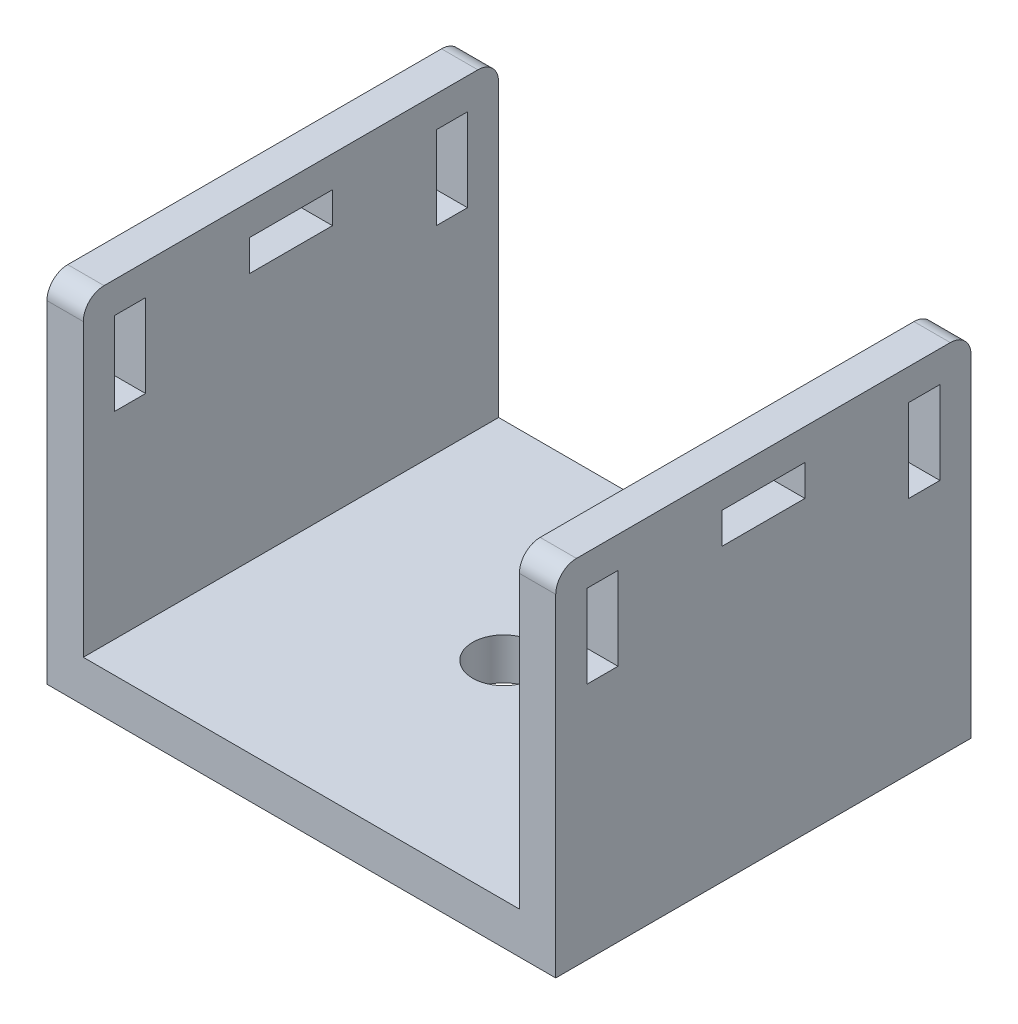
ISO-10303-21;
HEADER;
FILE_DESCRIPTION(('STEP AP214'),'2;1');
FILE_NAME('part.step','',(''),(''),'','','');
FILE_SCHEMA(('AUTOMOTIVE_DESIGN { 1 0 10303 214 1 1 1 1 }'));
ENDSEC;
DATA;
#1=APPLICATION_CONTEXT('core data for automotive mechanical design processes');
#2=APPLICATION_PROTOCOL_DEFINITION('international standard','automotive_design',2000,#1);
#3=PRODUCT_CONTEXT('',#1,'mechanical');
#4=PRODUCT('Part','Part','',(#3));
#5=PRODUCT_RELATED_PRODUCT_CATEGORY('part','',(#4));
#6=PRODUCT_DEFINITION_FORMATION('','',#4);
#7=PRODUCT_DEFINITION_CONTEXT('part definition',#1,'design');
#8=PRODUCT_DEFINITION('design','',#6,#7);
#9=PRODUCT_DEFINITION_SHAPE('','',#8);
#10=(LENGTH_UNIT() NAMED_UNIT(*) SI_UNIT(.MILLI.,.METRE.));
#11=(NAMED_UNIT(*) PLANE_ANGLE_UNIT() SI_UNIT($,.RADIAN.));
#12=(NAMED_UNIT(*) SI_UNIT($,.STERADIAN.) SOLID_ANGLE_UNIT());
#13=UNCERTAINTY_MEASURE_WITH_UNIT(LENGTH_MEASURE(1.E-05),#10,'distance_accuracy_value','');
#14=(GEOMETRIC_REPRESENTATION_CONTEXT(3) GLOBAL_UNCERTAINTY_ASSIGNED_CONTEXT((#13)) GLOBAL_UNIT_ASSIGNED_CONTEXT((#10,
#11,#12)) REPRESENTATION_CONTEXT('',''));
#15=CARTESIAN_POINT('',(0.,0.,0.));
#16=DIRECTION('',(0.,0.,1.));
#17=DIRECTION('',(1.,0.,0.));
#18=AXIS2_PLACEMENT_3D('',#15,#16,#17);
#19=CARTESIAN_POINT('',(1.75,17.,20.));
#20=DIRECTION('',(0.,-1.,0.));
#21=DIRECTION('',(0.,0.,-1.));
#22=AXIS2_PLACEMENT_3D('',#19,#20,#21);
#23=PLANE('',#22);
#24=DIRECTION('',(0.,0.,-1.));
#25=VECTOR('',#24,1.);
#26=CARTESIAN_POINT('',(0.,17.,20.));
#27=LINE('',#26,#25);
#28=CARTESIAN_POINT('',(0.,17.,19.));
#29=VERTEX_POINT('',#28);
#30=CARTESIAN_POINT('',(0.,17.,1.));
#31=VERTEX_POINT('',#30);
#32=EDGE_CURVE('E469',#29,#31,#27,.T.);
#33=ORIENTED_EDGE('',*,*,#32,.F.);
#34=DIRECTION('',(-1.,0.,0.));
#35=VECTOR('',#34,1.);
#36=CARTESIAN_POINT('',(1.75,17.,19.));
#37=LINE('',#36,#35);
#38=CARTESIAN_POINT('',(1.75,17.,19.));
#39=VERTEX_POINT('',#38);
#40=EDGE_CURVE('E54',#29,#39,#37,.F.);
#41=ORIENTED_EDGE('',*,*,#40,.T.);
#42=DIRECTION('',(0.,0.,-1.));
#43=VECTOR('',#42,1.);
#44=CARTESIAN_POINT('',(1.75,17.,20.));
#45=LINE('',#44,#43);
#46=CARTESIAN_POINT('',(1.75,17.,1.));
#47=VERTEX_POINT('',#46);
#48=EDGE_CURVE('E438',#39,#47,#45,.T.);
#49=ORIENTED_EDGE('',*,*,#48,.T.);
#50=DIRECTION('',(-1.,0.,0.));
#51=VECTOR('',#50,1.);
#52=CARTESIAN_POINT('',(1.75,17.,1.));
#53=LINE('',#52,#51);
#54=EDGE_CURVE('E535',#47,#31,#53,.T.);
#55=ORIENTED_EDGE('',*,*,#54,.T.);
#56=EDGE_LOOP('',(#33,#41,#49,#55));
#57=FACE_BOUND('',#56,.T.);
#58=ADVANCED_FACE('F33',(#57),#23,.F.);
#59=CARTESIAN_POINT('',(0.,17.,20.));
#60=DIRECTION('',(1.,0.,0.));
#61=DIRECTION('',(0.,1.,0.));
#62=AXIS2_PLACEMENT_3D('',#59,#60,#61);
#63=PLANE('',#62);
#64=DIRECTION('',(0.,0.,-1.));
#65=VECTOR('',#64,1.);
#66=CARTESIAN_POINT('',(0.,11.5,20.));
#67=LINE('',#66,#65);
#68=CARTESIAN_POINT('',(0.,11.5,3.));
#69=VERTEX_POINT('',#68);
#70=CARTESIAN_POINT('',(0.,11.5,1.5));
#71=VERTEX_POINT('',#70);
#72=EDGE_CURVE('E317',#69,#71,#67,.T.);
#73=ORIENTED_EDGE('',*,*,#72,.T.);
#74=DIRECTION('',(0.,1.,0.));
#75=VECTOR('',#74,1.);
#76=CARTESIAN_POINT('',(0.,17.,1.5));
#77=LINE('',#76,#75);
#78=CARTESIAN_POINT('',(0.,15.5,1.5));
#79=VERTEX_POINT('',#78);
#80=EDGE_CURVE('E323',#71,#79,#77,.T.);
#81=ORIENTED_EDGE('',*,*,#80,.T.);
#82=DIRECTION('',(0.,0.,1.));
#83=VECTOR('',#82,1.);
#84=CARTESIAN_POINT('',(0.,15.5,20.));
#85=LINE('',#84,#83);
#86=CARTESIAN_POINT('',(0.,15.5,3.));
#87=VERTEX_POINT('',#86);
#88=EDGE_CURVE('E307',#79,#87,#85,.T.);
#89=ORIENTED_EDGE('',*,*,#88,.T.);
#90=DIRECTION('',(0.,-1.,0.));
#91=VECTOR('',#90,1.);
#92=CARTESIAN_POINT('',(0.,17.,3.));
#93=LINE('',#92,#91);
#94=EDGE_CURVE('E311',#87,#69,#93,.T.);
#95=ORIENTED_EDGE('',*,*,#94,.T.);
#96=EDGE_LOOP('',(#73,#81,#89,#95));
#97=FACE_BOUND('',#96,.T.);
#98=DIRECTION('',(0.,0.,1.));
#99=VECTOR('',#98,1.);
#100=CARTESIAN_POINT('',(0.,15.5,20.));
#101=LINE('',#100,#99);
#102=CARTESIAN_POINT('',(0.,15.5,17.));
#103=VERTEX_POINT('',#102);
#104=CARTESIAN_POINT('',(0.,15.5,18.5));
#105=VERTEX_POINT('',#104);
#106=EDGE_CURVE('E365',#103,#105,#101,.T.);
#107=ORIENTED_EDGE('',*,*,#106,.T.);
#108=DIRECTION('',(0.,-1.,0.));
#109=VECTOR('',#108,1.);
#110=CARTESIAN_POINT('',(0.,17.,18.5));
#111=LINE('',#110,#109);
#112=CARTESIAN_POINT('',(0.,11.5,18.5));
#113=VERTEX_POINT('',#112);
#114=EDGE_CURVE('E371',#105,#113,#111,.T.);
#115=ORIENTED_EDGE('',*,*,#114,.T.);
#116=DIRECTION('',(0.,0.,-1.));
#117=VECTOR('',#116,1.);
#118=CARTESIAN_POINT('',(0.,11.5,20.));
#119=LINE('',#118,#117);
#120=CARTESIAN_POINT('',(0.,11.5,17.));
#121=VERTEX_POINT('',#120);
#122=EDGE_CURVE('E353',#113,#121,#119,.T.);
#123=ORIENTED_EDGE('',*,*,#122,.T.);
#124=DIRECTION('',(0.,1.,0.));
#125=VECTOR('',#124,1.);
#126=CARTESIAN_POINT('',(0.,17.,17.));
#127=LINE('',#126,#125);
#128=EDGE_CURVE('E359',#121,#103,#127,.T.);
#129=ORIENTED_EDGE('',*,*,#128,.T.);
#130=EDGE_LOOP('',(#107,#115,#123,#129));
#131=FACE_BOUND('',#130,.T.);
#132=DIRECTION('',(0.,0.,1.));
#133=VECTOR('',#132,1.);
#134=CARTESIAN_POINT('',(0.,15.5,20.));
#135=LINE('',#134,#133);
#136=CARTESIAN_POINT('',(0.,15.5,8.));
#137=VERTEX_POINT('',#136);
#138=CARTESIAN_POINT('',(0.,15.5,12.));
#139=VERTEX_POINT('',#138);
#140=EDGE_CURVE('E413',#137,#139,#135,.T.);
#141=ORIENTED_EDGE('',*,*,#140,.T.);
#142=DIRECTION('',(0.,-1.,0.));
#143=VECTOR('',#142,1.);
#144=CARTESIAN_POINT('',(0.,17.,12.));
#145=LINE('',#144,#143);
#146=CARTESIAN_POINT('',(0.,14.,12.));
#147=VERTEX_POINT('',#146);
#148=EDGE_CURVE('E419',#139,#147,#145,.T.);
#149=ORIENTED_EDGE('',*,*,#148,.T.);
#150=DIRECTION('',(0.,0.,-1.));
#151=VECTOR('',#150,1.);
#152=CARTESIAN_POINT('',(0.,14.,20.));
#153=LINE('',#152,#151);
#154=CARTESIAN_POINT('',(0.,14.,8.));
#155=VERTEX_POINT('',#154);
#156=EDGE_CURVE('E401',#147,#155,#153,.T.);
#157=ORIENTED_EDGE('',*,*,#156,.T.);
#158=DIRECTION('',(0.,1.,0.));
#159=VECTOR('',#158,1.);
#160=CARTESIAN_POINT('',(0.,17.,8.));
#161=LINE('',#160,#159);
#162=EDGE_CURVE('E407',#155,#137,#161,.T.);
#163=ORIENTED_EDGE('',*,*,#162,.T.);
#164=EDGE_LOOP('',(#141,#149,#157,#163));
#165=FACE_BOUND('',#164,.T.);
#166=DIRECTION('',(0.,-1.,0.));
#167=VECTOR('',#166,1.);
#168=CARTESIAN_POINT('',(0.,17.,20.));
#169=LINE('',#168,#167);
#170=CARTESIAN_POINT('',(0.,16.,20.));
#171=VERTEX_POINT('',#170);
#172=CARTESIAN_POINT('',(0.,0.,20.));
#173=VERTEX_POINT('',#172);
#174=EDGE_CURVE('E423',#171,#173,#169,.T.);
#175=ORIENTED_EDGE('',*,*,#174,.F.);
#176=CARTESIAN_POINT('',(0.,16.,19.));
#177=DIRECTION('',(1.,0.,0.));
#178=DIRECTION('',(0.,1.,0.));
#179=AXIS2_PLACEMENT_3D('',#176,#177,#178);
#180=CIRCLE('',#179,1.);
#181=EDGE_CURVE('E533',#171,#29,#180,.F.);
#182=ORIENTED_EDGE('',*,*,#181,.T.);
#183=ORIENTED_EDGE('',*,*,#32,.T.);
#184=CARTESIAN_POINT('',(0.,16.,1.));
#185=DIRECTION('',(1.,0.,0.));
#186=DIRECTION('',(0.,1.,0.));
#187=AXIS2_PLACEMENT_3D('',#184,#185,#186);
#188=CIRCLE('',#187,1.);
#189=CARTESIAN_POINT('',(0.,16.,0.));
#190=VERTEX_POINT('',#189);
#191=EDGE_CURVE('E531',#31,#190,#188,.F.);
#192=ORIENTED_EDGE('',*,*,#191,.T.);
#193=DIRECTION('',(0.,-1.,0.));
#194=VECTOR('',#193,1.);
#195=CARTESIAN_POINT('',(0.,17.,0.));
#196=LINE('',#195,#194);
#197=CARTESIAN_POINT('',(0.,0.,0.));
#198=VERTEX_POINT('',#197);
#199=EDGE_CURVE('E422',#190,#198,#196,.T.);
#200=ORIENTED_EDGE('',*,*,#199,.T.);
#201=DIRECTION('',(0.,0.,-1.));
#202=VECTOR('',#201,1.);
#203=CARTESIAN_POINT('',(0.,0.,20.));
#204=LINE('',#203,#202);
#205=EDGE_CURVE('E466',#173,#198,#204,.T.);
#206=ORIENTED_EDGE('',*,*,#205,.F.);
#207=EDGE_LOOP('',(#175,#182,#183,#192,#200,#206));
#208=FACE_BOUND('',#207,.T.);
#209=ADVANCED_FACE('F542',(#97,#131,#165,#208),#63,.F.);
#210=CARTESIAN_POINT('',(0.,0.,20.));
#211=DIRECTION('',(0.,1.,0.));
#212=DIRECTION('',(0.,0.,1.));
#213=AXIS2_PLACEMENT_3D('',#210,#211,#212);
#214=PLANE('',#213);
#215=CARTESIAN_POINT('',(12.,0.,10.));
#216=DIRECTION('',(0.,1.,0.));
#217=DIRECTION('',(0.,0.,1.));
#218=AXIS2_PLACEMENT_3D('',#215,#216,#217);
#219=CIRCLE('',#218,1.5);
#220=CARTESIAN_POINT('',(12.,0.,11.5));
#221=VERTEX_POINT('',#220);
#222=EDGE_CURVE('E631',#221,#221,#219,.T.);
#223=ORIENTED_EDGE('',*,*,#222,.T.);
#224=EDGE_LOOP('',(#223));
#225=FACE_BOUND('',#224,.T.);
#226=DIRECTION('',(1.,0.,0.));
#227=VECTOR('',#226,1.);
#228=CARTESIAN_POINT('',(0.,0.,0.));
#229=LINE('',#228,#227);
#230=CARTESIAN_POINT('',(24.5,0.,0.));
#231=VERTEX_POINT('',#230);
#232=EDGE_CURVE('E440',#198,#231,#229,.T.);
#233=ORIENTED_EDGE('',*,*,#232,.T.);
#234=DIRECTION('',(0.,0.,-1.));
#235=VECTOR('',#234,1.);
#236=CARTESIAN_POINT('',(24.5,0.,20.));
#237=LINE('',#236,#235);
#238=CARTESIAN_POINT('',(24.5,0.,20.));
#239=VERTEX_POINT('',#238);
#240=EDGE_CURVE('E463',#239,#231,#237,.T.);
#241=ORIENTED_EDGE('',*,*,#240,.F.);
#242=DIRECTION('',(1.,0.,0.));
#243=VECTOR('',#242,1.);
#244=CARTESIAN_POINT('',(0.,0.,20.));
#245=LINE('',#244,#243);
#246=EDGE_CURVE('E425',#173,#239,#245,.T.);
#247=ORIENTED_EDGE('',*,*,#246,.F.);
#248=ORIENTED_EDGE('',*,*,#205,.T.);
#249=EDGE_LOOP('',(#233,#241,#247,#248));
#250=FACE_BOUND('',#249,.T.);
#251=ADVANCED_FACE('F573',(#225,#250),#214,.F.);
#252=CARTESIAN_POINT('',(24.5,0.,20.));
#253=DIRECTION('',(-1.,0.,0.));
#254=DIRECTION('',(0.,0.,1.));
#255=AXIS2_PLACEMENT_3D('',#252,#253,#254);
#256=PLANE('',#255);
#257=DIRECTION('',(0.,0.,1.));
#258=VECTOR('',#257,1.);
#259=CARTESIAN_POINT('',(24.5,15.5,1.5));
#260=LINE('',#259,#258);
#261=CARTESIAN_POINT('',(24.5,15.5,1.5));
#262=VERTEX_POINT('',#261);
#263=CARTESIAN_POINT('',(24.5,15.5,3.));
#264=VERTEX_POINT('',#263);
#265=EDGE_CURVE('E282',#262,#264,#260,.T.);
#266=ORIENTED_EDGE('',*,*,#265,.F.);
#267=DIRECTION('',(0.,1.,0.));
#268=VECTOR('',#267,1.);
#269=CARTESIAN_POINT('',(24.5,15.5,1.5));
#270=LINE('',#269,#268);
#271=CARTESIAN_POINT('',(24.5,11.5,1.5));
#272=VERTEX_POINT('',#271);
#273=EDGE_CURVE('E288',#272,#262,#270,.T.);
#274=ORIENTED_EDGE('',*,*,#273,.F.);
#275=DIRECTION('',(0.,0.,-1.));
#276=VECTOR('',#275,1.);
#277=CARTESIAN_POINT('',(24.5,11.5,1.5));
#278=LINE('',#277,#276);
#279=CARTESIAN_POINT('',(24.5,11.5,3.));
#280=VERTEX_POINT('',#279);
#281=EDGE_CURVE('E293',#280,#272,#278,.T.);
#282=ORIENTED_EDGE('',*,*,#281,.F.);
#283=DIRECTION('',(0.,-1.,0.));
#284=VECTOR('',#283,1.);
#285=CARTESIAN_POINT('',(24.5,15.5,3.));
#286=LINE('',#285,#284);
#287=EDGE_CURVE('E271',#264,#280,#286,.T.);
#288=ORIENTED_EDGE('',*,*,#287,.F.);
#289=EDGE_LOOP('',(#266,#274,#282,#288));
#290=FACE_BOUND('',#289,.T.);
#291=DIRECTION('',(0.,0.,-1.));
#292=VECTOR('',#291,1.);
#293=CARTESIAN_POINT('',(24.5,11.5,18.5));
#294=LINE('',#293,#292);
#295=CARTESIAN_POINT('',(24.5,11.5,18.5));
#296=VERTEX_POINT('',#295);
#297=CARTESIAN_POINT('',(24.5,11.5,17.));
#298=VERTEX_POINT('',#297);
#299=EDGE_CURVE('E328',#296,#298,#294,.T.);
#300=ORIENTED_EDGE('',*,*,#299,.F.);
#301=DIRECTION('',(0.,-1.,0.));
#302=VECTOR('',#301,1.);
#303=CARTESIAN_POINT('',(24.5,15.5,18.5));
#304=LINE('',#303,#302);
#305=CARTESIAN_POINT('',(24.5,15.5,18.5));
#306=VERTEX_POINT('',#305);
#307=EDGE_CURVE('E326',#306,#296,#304,.T.);
#308=ORIENTED_EDGE('',*,*,#307,.F.);
#309=DIRECTION('',(0.,0.,1.));
#310=VECTOR('',#309,1.);
#311=CARTESIAN_POINT('',(24.5,15.5,18.5));
#312=LINE('',#311,#310);
#313=CARTESIAN_POINT('',(24.5,15.5,17.));
#314=VERTEX_POINT('',#313);
#315=EDGE_CURVE('E334',#314,#306,#312,.T.);
#316=ORIENTED_EDGE('',*,*,#315,.F.);
#317=DIRECTION('',(0.,1.,0.));
#318=VECTOR('',#317,1.);
#319=CARTESIAN_POINT('',(24.5,15.5,17.));
#320=LINE('',#319,#318);
#321=EDGE_CURVE('E331',#298,#314,#320,.T.);
#322=ORIENTED_EDGE('',*,*,#321,.F.);
#323=EDGE_LOOP('',(#300,#308,#316,#322));
#324=FACE_BOUND('',#323,.T.);
#325=DIRECTION('',(0.,0.,-1.));
#326=VECTOR('',#325,1.);
#327=CARTESIAN_POINT('',(24.5,14.,12.));
#328=LINE('',#327,#326);
#329=CARTESIAN_POINT('',(24.5,14.,12.));
#330=VERTEX_POINT('',#329);
#331=CARTESIAN_POINT('',(24.5,14.,8.));
#332=VERTEX_POINT('',#331);
#333=EDGE_CURVE('E376',#330,#332,#328,.T.);
#334=ORIENTED_EDGE('',*,*,#333,.F.);
#335=DIRECTION('',(0.,-1.,0.));
#336=VECTOR('',#335,1.);
#337=CARTESIAN_POINT('',(24.5,15.5,12.));
#338=LINE('',#337,#336);
#339=CARTESIAN_POINT('',(24.5,15.5,12.));
#340=VERTEX_POINT('',#339);
#341=EDGE_CURVE('E374',#340,#330,#338,.T.);
#342=ORIENTED_EDGE('',*,*,#341,.F.);
#343=DIRECTION('',(0.,0.,1.));
#344=VECTOR('',#343,1.);
#345=CARTESIAN_POINT('',(24.5,15.5,12.));
#346=LINE('',#345,#344);
#347=CARTESIAN_POINT('',(24.5,15.5,8.));
#348=VERTEX_POINT('',#347);
#349=EDGE_CURVE('E382',#348,#340,#346,.T.);
#350=ORIENTED_EDGE('',*,*,#349,.F.);
#351=DIRECTION('',(0.,1.,0.));
#352=VECTOR('',#351,1.);
#353=CARTESIAN_POINT('',(24.5,15.5,8.));
#354=LINE('',#353,#352);
#355=EDGE_CURVE('E379',#332,#348,#354,.T.);
#356=ORIENTED_EDGE('',*,*,#355,.F.);
#357=EDGE_LOOP('',(#334,#342,#350,#356));
#358=FACE_BOUND('',#357,.T.);
#359=DIRECTION('',(0.,1.,0.));
#360=VECTOR('',#359,1.);
#361=CARTESIAN_POINT('',(24.5,0.,0.));
#362=LINE('',#361,#360);
#363=CARTESIAN_POINT('',(24.5,16.,0.));
#364=VERTEX_POINT('',#363);
#365=EDGE_CURVE('E442',#231,#364,#362,.T.);
#366=ORIENTED_EDGE('',*,*,#365,.T.);
#367=CARTESIAN_POINT('',(24.5,16.,1.));
#368=DIRECTION('',(-1.,0.,0.));
#369=DIRECTION('',(0.,0.,1.));
#370=AXIS2_PLACEMENT_3D('',#367,#368,#369);
#371=CIRCLE('',#370,1.);
#372=CARTESIAN_POINT('',(24.5,17.,1.));
#373=VERTEX_POINT('',#372);
#374=EDGE_CURVE('E523',#364,#373,#371,.F.);
#375=ORIENTED_EDGE('',*,*,#374,.T.);
#376=DIRECTION('',(0.,0.,-1.));
#377=VECTOR('',#376,1.);
#378=CARTESIAN_POINT('',(24.5,17.,20.));
#379=LINE('',#378,#377);
#380=CARTESIAN_POINT('',(24.5,17.,19.));
#381=VERTEX_POINT('',#380);
#382=EDGE_CURVE('E460',#381,#373,#379,.T.);
#383=ORIENTED_EDGE('',*,*,#382,.F.);
#384=CARTESIAN_POINT('',(24.5,16.,19.));
#385=DIRECTION('',(-1.,0.,0.));
#386=DIRECTION('',(0.,0.,1.));
#387=AXIS2_PLACEMENT_3D('',#384,#385,#386);
#388=CIRCLE('',#387,1.);
#389=CARTESIAN_POINT('',(24.5,16.,20.));
#390=VERTEX_POINT('',#389);
#391=EDGE_CURVE('E521',#381,#390,#388,.F.);
#392=ORIENTED_EDGE('',*,*,#391,.T.);
#393=DIRECTION('',(0.,1.,0.));
#394=VECTOR('',#393,1.);
#395=CARTESIAN_POINT('',(24.5,0.,20.));
#396=LINE('',#395,#394);
#397=EDGE_CURVE('E428',#239,#390,#396,.T.);
#398=ORIENTED_EDGE('',*,*,#397,.F.);
#399=ORIENTED_EDGE('',*,*,#240,.T.);
#400=EDGE_LOOP('',(#366,#375,#383,#392,#398,#399));
#401=FACE_BOUND('',#400,.T.);
#402=ADVANCED_FACE('F290',(#290,#324,#358,#401),#256,.F.);
#403=CARTESIAN_POINT('',(24.5,17.,20.));
#404=DIRECTION('',(0.,-1.,0.));
#405=DIRECTION('',(0.,0.,-1.));
#406=AXIS2_PLACEMENT_3D('',#403,#404,#405);
#407=PLANE('',#406);
#408=ORIENTED_EDGE('',*,*,#382,.T.);
#409=DIRECTION('',(-1.,0.,0.));
#410=VECTOR('',#409,1.);
#411=CARTESIAN_POINT('',(24.5,17.,1.));
#412=LINE('',#411,#410);
#413=CARTESIAN_POINT('',(22.75,17.,1.));
#414=VERTEX_POINT('',#413);
#415=EDGE_CURVE('E510',#373,#414,#412,.T.);
#416=ORIENTED_EDGE('',*,*,#415,.T.);
#417=DIRECTION('',(0.,0.,-1.));
#418=VECTOR('',#417,1.);
#419=CARTESIAN_POINT('',(22.75,17.,20.));
#420=LINE('',#419,#418);
#421=CARTESIAN_POINT('',(22.75,17.,19.));
#422=VERTEX_POINT('',#421);
#423=EDGE_CURVE('E457',#422,#414,#420,.T.);
#424=ORIENTED_EDGE('',*,*,#423,.F.);
#425=DIRECTION('',(-1.,0.,0.));
#426=VECTOR('',#425,1.);
#427=CARTESIAN_POINT('',(24.5,17.,19.));
#428=LINE('',#427,#426);
#429=EDGE_CURVE('E508',#422,#381,#428,.F.);
#430=ORIENTED_EDGE('',*,*,#429,.T.);
#431=EDGE_LOOP('',(#408,#416,#424,#430));
#432=FACE_BOUND('',#431,.T.);
#433=ADVANCED_FACE('F602',(#432),#407,.F.);
#434=CARTESIAN_POINT('',(22.75,17.,20.));
#435=DIRECTION('',(1.,0.,0.));
#436=DIRECTION('',(0.,1.,0.));
#437=AXIS2_PLACEMENT_3D('',#434,#435,#436);
#438=PLANE('',#437);
#439=DIRECTION('',(0.,0.,-1.));
#440=VECTOR('',#439,1.);
#441=CARTESIAN_POINT('',(22.75,11.5,20.));
#442=LINE('',#441,#440);
#443=CARTESIAN_POINT('',(22.75,11.5,3.));
#444=VERTEX_POINT('',#443);
#445=CARTESIAN_POINT('',(22.75,11.5,1.5));
#446=VERTEX_POINT('',#445);
#447=EDGE_CURVE('E314',#444,#446,#442,.T.);
#448=ORIENTED_EDGE('',*,*,#447,.T.);
#449=DIRECTION('',(0.,1.,0.));
#450=VECTOR('',#449,1.);
#451=CARTESIAN_POINT('',(22.75,17.,1.5));
#452=LINE('',#451,#450);
#453=CARTESIAN_POINT('',(22.75,15.5,1.5));
#454=VERTEX_POINT('',#453);
#455=EDGE_CURVE('E320',#446,#454,#452,.T.);
#456=ORIENTED_EDGE('',*,*,#455,.T.);
#457=DIRECTION('',(0.,0.,1.));
#458=VECTOR('',#457,1.);
#459=CARTESIAN_POINT('',(22.75,15.5,20.));
#460=LINE('',#459,#458);
#461=CARTESIAN_POINT('',(22.75,15.5,3.));
#462=VERTEX_POINT('',#461);
#463=EDGE_CURVE('E305',#454,#462,#460,.T.);
#464=ORIENTED_EDGE('',*,*,#463,.T.);
#465=DIRECTION('',(0.,-1.,0.));
#466=VECTOR('',#465,1.);
#467=CARTESIAN_POINT('',(22.75,17.,3.));
#468=LINE('',#467,#466);
#469=EDGE_CURVE('E274',#462,#444,#468,.T.);
#470=ORIENTED_EDGE('',*,*,#469,.T.);
#471=EDGE_LOOP('',(#448,#456,#464,#470));
#472=FACE_BOUND('',#471,.T.);
#473=DIRECTION('',(0.,0.,1.));
#474=VECTOR('',#473,1.);
#475=CARTESIAN_POINT('',(22.75,15.5,20.));
#476=LINE('',#475,#474);
#477=CARTESIAN_POINT('',(22.75,15.5,17.));
#478=VERTEX_POINT('',#477);
#479=CARTESIAN_POINT('',(22.75,15.5,18.5));
#480=VERTEX_POINT('',#479);
#481=EDGE_CURVE('E362',#478,#480,#476,.T.);
#482=ORIENTED_EDGE('',*,*,#481,.T.);
#483=DIRECTION('',(0.,-1.,0.));
#484=VECTOR('',#483,1.);
#485=CARTESIAN_POINT('',(22.75,17.,18.5));
#486=LINE('',#485,#484);
#487=CARTESIAN_POINT('',(22.75,11.5,18.5));
#488=VERTEX_POINT('',#487);
#489=EDGE_CURVE('E368',#480,#488,#486,.T.);
#490=ORIENTED_EDGE('',*,*,#489,.T.);
#491=DIRECTION('',(0.,0.,-1.));
#492=VECTOR('',#491,1.);
#493=CARTESIAN_POINT('',(22.75,11.5,20.));
#494=LINE('',#493,#492);
#495=CARTESIAN_POINT('',(22.75,11.5,17.));
#496=VERTEX_POINT('',#495);
#497=EDGE_CURVE('E350',#488,#496,#494,.T.);
#498=ORIENTED_EDGE('',*,*,#497,.T.);
#499=DIRECTION('',(0.,1.,0.));
#500=VECTOR('',#499,1.);
#501=CARTESIAN_POINT('',(22.75,17.,17.));
#502=LINE('',#501,#500);
#503=EDGE_CURVE('E356',#496,#478,#502,.T.);
#504=ORIENTED_EDGE('',*,*,#503,.T.);
#505=EDGE_LOOP('',(#482,#490,#498,#504));
#506=FACE_BOUND('',#505,.T.);
#507=DIRECTION('',(0.,0.,1.));
#508=VECTOR('',#507,1.);
#509=CARTESIAN_POINT('',(22.75,15.5,20.));
#510=LINE('',#509,#508);
#511=CARTESIAN_POINT('',(22.75,15.5,8.));
#512=VERTEX_POINT('',#511);
#513=CARTESIAN_POINT('',(22.75,15.5,12.));
#514=VERTEX_POINT('',#513);
#515=EDGE_CURVE('E410',#512,#514,#510,.T.);
#516=ORIENTED_EDGE('',*,*,#515,.T.);
#517=DIRECTION('',(0.,-1.,0.));
#518=VECTOR('',#517,1.);
#519=CARTESIAN_POINT('',(22.75,17.,12.));
#520=LINE('',#519,#518);
#521=CARTESIAN_POINT('',(22.75,14.,12.));
#522=VERTEX_POINT('',#521);
#523=EDGE_CURVE('E416',#514,#522,#520,.T.);
#524=ORIENTED_EDGE('',*,*,#523,.T.);
#525=DIRECTION('',(0.,0.,-1.));
#526=VECTOR('',#525,1.);
#527=CARTESIAN_POINT('',(22.75,14.,20.));
#528=LINE('',#527,#526);
#529=CARTESIAN_POINT('',(22.75,14.,8.));
#530=VERTEX_POINT('',#529);
#531=EDGE_CURVE('E398',#522,#530,#528,.T.);
#532=ORIENTED_EDGE('',*,*,#531,.T.);
#533=DIRECTION('',(0.,1.,0.));
#534=VECTOR('',#533,1.);
#535=CARTESIAN_POINT('',(22.75,17.,8.));
#536=LINE('',#535,#534);
#537=EDGE_CURVE('E404',#530,#512,#536,.T.);
#538=ORIENTED_EDGE('',*,*,#537,.T.);
#539=EDGE_LOOP('',(#516,#524,#532,#538));
#540=FACE_BOUND('',#539,.T.);
#541=ORIENTED_EDGE('',*,*,#423,.T.);
#542=CARTESIAN_POINT('',(22.75,16.,1.));
#543=DIRECTION('',(1.,0.,0.));
#544=DIRECTION('',(0.,1.,0.));
#545=AXIS2_PLACEMENT_3D('',#542,#543,#544);
#546=CIRCLE('',#545,1.);
#547=CARTESIAN_POINT('',(22.75,16.,0.));
#548=VERTEX_POINT('',#547);
#549=EDGE_CURVE('E515',#414,#548,#546,.F.);
#550=ORIENTED_EDGE('',*,*,#549,.T.);
#551=DIRECTION('',(0.,-1.,0.));
#552=VECTOR('',#551,1.);
#553=CARTESIAN_POINT('',(22.75,17.,0.));
#554=LINE('',#553,#552);
#555=CARTESIAN_POINT('',(22.75,2.,0.));
#556=VERTEX_POINT('',#555);
#557=EDGE_CURVE('E445',#548,#556,#554,.T.);
#558=ORIENTED_EDGE('',*,*,#557,.T.);
#559=DIRECTION('',(0.,0.,-1.));
#560=VECTOR('',#559,1.);
#561=CARTESIAN_POINT('',(22.75,2.,20.));
#562=LINE('',#561,#560);
#563=CARTESIAN_POINT('',(22.75,2.,20.));
#564=VERTEX_POINT('',#563);
#565=EDGE_CURVE('E454',#564,#556,#562,.T.);
#566=ORIENTED_EDGE('',*,*,#565,.F.);
#567=DIRECTION('',(0.,-1.,0.));
#568=VECTOR('',#567,1.);
#569=CARTESIAN_POINT('',(22.75,17.,20.));
#570=LINE('',#569,#568);
#571=CARTESIAN_POINT('',(22.75,16.,20.));
#572=VERTEX_POINT('',#571);
#573=EDGE_CURVE('E431',#572,#564,#570,.T.);
#574=ORIENTED_EDGE('',*,*,#573,.F.);
#575=CARTESIAN_POINT('',(22.75,16.,19.));
#576=DIRECTION('',(1.,0.,0.));
#577=DIRECTION('',(0.,1.,0.));
#578=AXIS2_PLACEMENT_3D('',#575,#576,#577);
#579=CIRCLE('',#578,1.);
#580=EDGE_CURVE('E513',#572,#422,#579,.F.);
#581=ORIENTED_EDGE('',*,*,#580,.T.);
#582=EDGE_LOOP('',(#541,#550,#558,#566,#574,#581));
#583=FACE_BOUND('',#582,.T.);
#584=ADVANCED_FACE('F605',(#472,#506,#540,#583),#438,.F.);
#585=CARTESIAN_POINT('',(22.75,2.,20.));
#586=DIRECTION('',(0.,-1.,0.));
#587=DIRECTION('',(1.,0.,0.));
#588=AXIS2_PLACEMENT_3D('',#585,#586,#587);
#589=PLANE('',#588);
#590=CARTESIAN_POINT('',(12.,2.,10.));
#591=DIRECTION('',(0.,1.,0.));
#592=DIRECTION('',(-1.,0.,0.));
#593=AXIS2_PLACEMENT_3D('',#590,#591,#592);
#594=CIRCLE('',#593,1.5);
#595=CARTESIAN_POINT('',(10.5,2.,10.));
#596=VERTEX_POINT('',#595);
#597=EDGE_CURVE('E633',#596,#596,#594,.T.);
#598=ORIENTED_EDGE('',*,*,#597,.F.);
#599=EDGE_LOOP('',(#598));
#600=FACE_BOUND('',#599,.T.);
#601=DIRECTION('',(-1.,0.,0.));
#602=VECTOR('',#601,1.);
#603=CARTESIAN_POINT('',(22.75,2.,0.));
#604=LINE('',#603,#602);
#605=CARTESIAN_POINT('',(1.75,2.,0.));
#606=VERTEX_POINT('',#605);
#607=EDGE_CURVE('E447',#556,#606,#604,.T.);
#608=ORIENTED_EDGE('',*,*,#607,.T.);
#609=DIRECTION('',(0.,0.,-1.));
#610=VECTOR('',#609,1.);
#611=CARTESIAN_POINT('',(1.75,2.,20.));
#612=LINE('',#611,#610);
#613=CARTESIAN_POINT('',(1.75,2.,20.));
#614=VERTEX_POINT('',#613);
#615=EDGE_CURVE('E451',#614,#606,#612,.T.);
#616=ORIENTED_EDGE('',*,*,#615,.F.);
#617=DIRECTION('',(-1.,0.,0.));
#618=VECTOR('',#617,1.);
#619=CARTESIAN_POINT('',(22.75,2.,20.));
#620=LINE('',#619,#618);
#621=EDGE_CURVE('E433',#564,#614,#620,.T.);
#622=ORIENTED_EDGE('',*,*,#621,.F.);
#623=ORIENTED_EDGE('',*,*,#565,.T.);
#624=EDGE_LOOP('',(#608,#616,#622,#623));
#625=FACE_BOUND('',#624,.T.);
#626=ADVANCED_FACE('F607',(#600,#625),#589,.F.);
#627=CARTESIAN_POINT('',(1.75,2.,20.));
#628=DIRECTION('',(-1.,0.,0.));
#629=DIRECTION('',(0.,0.,1.));
#630=AXIS2_PLACEMENT_3D('',#627,#628,#629);
#631=PLANE('',#630);
#632=DIRECTION('',(0.,0.,-1.));
#633=VECTOR('',#632,1.);
#634=CARTESIAN_POINT('',(1.75,15.5,20.));
#635=LINE('',#634,#633);
#636=CARTESIAN_POINT('',(1.75,15.5,3.));
#637=VERTEX_POINT('',#636);
#638=CARTESIAN_POINT('',(1.75,15.5,1.5));
#639=VERTEX_POINT('',#638);
#640=EDGE_CURVE('E496',#637,#639,#635,.T.);
#641=ORIENTED_EDGE('',*,*,#640,.T.);
#642=DIRECTION('',(0.,-1.,0.));
#643=VECTOR('',#642,1.);
#644=CARTESIAN_POINT('',(1.75,2.00000000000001,1.49999999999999));
#645=LINE('',#644,#643);
#646=CARTESIAN_POINT('',(1.75,11.5,1.5));
#647=VERTEX_POINT('',#646);
#648=EDGE_CURVE('E505',#639,#647,#645,.T.);
#649=ORIENTED_EDGE('',*,*,#648,.T.);
#650=DIRECTION('',(0.,0.,1.));
#651=VECTOR('',#650,1.);
#652=CARTESIAN_POINT('',(1.75,11.5,20.));
#653=LINE('',#652,#651);
#654=CARTESIAN_POINT('',(1.75,11.5,3.));
#655=VERTEX_POINT('',#654);
#656=EDGE_CURVE('E502',#647,#655,#653,.T.);
#657=ORIENTED_EDGE('',*,*,#656,.T.);
#658=DIRECTION('',(0.,1.,0.));
#659=VECTOR('',#658,1.);
#660=CARTESIAN_POINT('',(1.75,2.,3.));
#661=LINE('',#660,#659);
#662=EDGE_CURVE('E499',#655,#637,#661,.T.);
#663=ORIENTED_EDGE('',*,*,#662,.T.);
#664=EDGE_LOOP('',(#641,#649,#657,#663));
#665=FACE_BOUND('',#664,.T.);
#666=DIRECTION('',(0.,0.,1.));
#667=VECTOR('',#666,1.);
#668=CARTESIAN_POINT('',(1.75,11.5,20.));
#669=LINE('',#668,#667);
#670=CARTESIAN_POINT('',(1.75,11.5,17.));
#671=VERTEX_POINT('',#670);
#672=CARTESIAN_POINT('',(1.75,11.5,18.5));
#673=VERTEX_POINT('',#672);
#674=EDGE_CURVE('E484',#671,#673,#669,.T.);
#675=ORIENTED_EDGE('',*,*,#674,.T.);
#676=DIRECTION('',(0.,1.,0.));
#677=VECTOR('',#676,1.);
#678=CARTESIAN_POINT('',(1.75,2.,18.5));
#679=LINE('',#678,#677);
#680=CARTESIAN_POINT('',(1.75,15.5,18.5));
#681=VERTEX_POINT('',#680);
#682=EDGE_CURVE('E493',#673,#681,#679,.T.);
#683=ORIENTED_EDGE('',*,*,#682,.T.);
#684=DIRECTION('',(0.,0.,-1.));
#685=VECTOR('',#684,1.);
#686=CARTESIAN_POINT('',(1.75,15.5,20.));
#687=LINE('',#686,#685);
#688=CARTESIAN_POINT('',(1.75,15.5,17.));
#689=VERTEX_POINT('',#688);
#690=EDGE_CURVE('E490',#681,#689,#687,.T.);
#691=ORIENTED_EDGE('',*,*,#690,.T.);
#692=DIRECTION('',(0.,-1.,0.));
#693=VECTOR('',#692,1.);
#694=CARTESIAN_POINT('',(1.75,2.,17.));
#695=LINE('',#694,#693);
#696=EDGE_CURVE('E487',#689,#671,#695,.T.);
#697=ORIENTED_EDGE('',*,*,#696,.T.);
#698=EDGE_LOOP('',(#675,#683,#691,#697));
#699=FACE_BOUND('',#698,.T.);
#700=DIRECTION('',(0.,0.,1.));
#701=VECTOR('',#700,1.);
#702=CARTESIAN_POINT('',(1.75,14.,20.));
#703=LINE('',#702,#701);
#704=CARTESIAN_POINT('',(1.75,14.,8.));
#705=VERTEX_POINT('',#704);
#706=CARTESIAN_POINT('',(1.75,14.,12.));
#707=VERTEX_POINT('',#706);
#708=EDGE_CURVE('E472',#705,#707,#703,.T.);
#709=ORIENTED_EDGE('',*,*,#708,.T.);
#710=DIRECTION('',(0.,1.,0.));
#711=VECTOR('',#710,1.);
#712=CARTESIAN_POINT('',(1.75,2.,12.));
#713=LINE('',#712,#711);
#714=CARTESIAN_POINT('',(1.75,15.5,12.));
#715=VERTEX_POINT('',#714);
#716=EDGE_CURVE('E481',#707,#715,#713,.T.);
#717=ORIENTED_EDGE('',*,*,#716,.T.);
#718=DIRECTION('',(0.,0.,-1.));
#719=VECTOR('',#718,1.);
#720=CARTESIAN_POINT('',(1.75,15.5,20.));
#721=LINE('',#720,#719);
#722=CARTESIAN_POINT('',(1.75,15.5,8.));
#723=VERTEX_POINT('',#722);
#724=EDGE_CURVE('E478',#715,#723,#721,.T.);
#725=ORIENTED_EDGE('',*,*,#724,.T.);
#726=DIRECTION('',(0.,-1.,0.));
#727=VECTOR('',#726,1.);
#728=CARTESIAN_POINT('',(1.75,2.,8.));
#729=LINE('',#728,#727);
#730=EDGE_CURVE('E475',#723,#705,#729,.T.);
#731=ORIENTED_EDGE('',*,*,#730,.T.);
#732=EDGE_LOOP('',(#709,#717,#725,#731));
#733=FACE_BOUND('',#732,.T.);
#734=ORIENTED_EDGE('',*,*,#48,.F.);
#735=CARTESIAN_POINT('',(1.75,16.,19.));
#736=DIRECTION('',(-1.,0.,0.));
#737=DIRECTION('',(0.,0.,1.));
#738=AXIS2_PLACEMENT_3D('',#735,#736,#737);
#739=CIRCLE('',#738,1.);
#740=CARTESIAN_POINT('',(1.75,16.,20.));
#741=VERTEX_POINT('',#740);
#742=EDGE_CURVE('E11',#39,#741,#739,.F.);
#743=ORIENTED_EDGE('',*,*,#742,.T.);
#744=DIRECTION('',(0.,1.,0.));
#745=VECTOR('',#744,1.);
#746=CARTESIAN_POINT('',(1.75,2.,20.));
#747=LINE('',#746,#745);
#748=EDGE_CURVE('E435',#614,#741,#747,.T.);
#749=ORIENTED_EDGE('',*,*,#748,.F.);
#750=ORIENTED_EDGE('',*,*,#615,.T.);
#751=DIRECTION('',(0.,1.,0.));
#752=VECTOR('',#751,1.);
#753=CARTESIAN_POINT('',(1.75,2.,0.));
#754=LINE('',#753,#752);
#755=CARTESIAN_POINT('',(1.75,16.,0.));
#756=VERTEX_POINT('',#755);
#757=EDGE_CURVE('E426',#606,#756,#754,.T.);
#758=ORIENTED_EDGE('',*,*,#757,.T.);
#759=CARTESIAN_POINT('',(1.75,16.,1.));
#760=DIRECTION('',(-1.,0.,0.));
#761=DIRECTION('',(0.,0.,1.));
#762=AXIS2_PLACEMENT_3D('',#759,#760,#761);
#763=CIRCLE('',#762,1.);
#764=EDGE_CURVE('E41',#756,#47,#763,.F.);
#765=ORIENTED_EDGE('',*,*,#764,.T.);
#766=EDGE_LOOP('',(#734,#743,#749,#750,#758,#765));
#767=FACE_BOUND('',#766,.T.);
#768=ADVANCED_FACE('F554',(#665,#699,#733,#767),#631,.F.);
#769=CARTESIAN_POINT('',(0.,0.,20.));
#770=DIRECTION('',(0.,0.,1.));
#771=DIRECTION('',(1.,0.,0.));
#772=AXIS2_PLACEMENT_3D('',#769,#770,#771);
#773=PLANE('',#772);
#774=ORIENTED_EDGE('',*,*,#397,.T.);
#775=DIRECTION('',(-1.,0.,0.));
#776=VECTOR('',#775,1.);
#777=CARTESIAN_POINT('',(22.75,16.,20.));
#778=LINE('',#777,#776);
#779=EDGE_CURVE('E528',#390,#572,#778,.T.);
#780=ORIENTED_EDGE('',*,*,#779,.T.);
#781=ORIENTED_EDGE('',*,*,#573,.T.);
#782=ORIENTED_EDGE('',*,*,#621,.T.);
#783=ORIENTED_EDGE('',*,*,#748,.T.);
#784=DIRECTION('',(-1.,0.,0.));
#785=VECTOR('',#784,1.);
#786=CARTESIAN_POINT('',(0.,16.,20.));
#787=LINE('',#786,#785);
#788=EDGE_CURVE('E525',#741,#171,#787,.T.);
#789=ORIENTED_EDGE('',*,*,#788,.T.);
#790=ORIENTED_EDGE('',*,*,#174,.T.);
#791=ORIENTED_EDGE('',*,*,#246,.T.);
#792=EDGE_LOOP('',(#774,#780,#781,#782,#783,#789,#790,#791));
#793=FACE_BOUND('',#792,.T.);
#794=ADVANCED_FACE('F550',(#793),#773,.T.);
#795=CARTESIAN_POINT('',(0.,0.,0.));
#796=DIRECTION('',(0.,0.,1.));
#797=DIRECTION('',(1.,0.,0.));
#798=AXIS2_PLACEMENT_3D('',#795,#796,#797);
#799=PLANE('',#798);
#800=ORIENTED_EDGE('',*,*,#557,.F.);
#801=DIRECTION('',(-1.,0.,0.));
#802=VECTOR('',#801,1.);
#803=CARTESIAN_POINT('',(0.,16.,0.));
#804=LINE('',#803,#802);
#805=EDGE_CURVE('E519',#548,#364,#804,.F.);
#806=ORIENTED_EDGE('',*,*,#805,.T.);
#807=ORIENTED_EDGE('',*,*,#365,.F.);
#808=ORIENTED_EDGE('',*,*,#232,.F.);
#809=ORIENTED_EDGE('',*,*,#199,.F.);
#810=DIRECTION('',(-1.,0.,0.));
#811=VECTOR('',#810,1.);
#812=CARTESIAN_POINT('',(0.,16.,0.));
#813=LINE('',#812,#811);
#814=EDGE_CURVE('E517',#190,#756,#813,.F.);
#815=ORIENTED_EDGE('',*,*,#814,.T.);
#816=ORIENTED_EDGE('',*,*,#757,.F.);
#817=ORIENTED_EDGE('',*,*,#607,.F.);
#818=EDGE_LOOP('',(#800,#806,#807,#808,#809,#815,#816,#817));
#819=FACE_BOUND('',#818,.T.);
#820=ADVANCED_FACE('F560',(#819),#799,.F.);
#821=CARTESIAN_POINT('',(-5.49999999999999,14.,12.));
#822=DIRECTION('',(0.,-1.,0.));
#823=DIRECTION('',(0.,0.,-1.));
#824=AXIS2_PLACEMENT_3D('',#821,#822,#823);
#825=PLANE('',#824);
#826=DIRECTION('',(1.,0.,0.));
#827=VECTOR('',#826,1.);
#828=CARTESIAN_POINT('',(-5.49999999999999,14.,12.));
#829=LINE('',#828,#827);
#830=EDGE_CURVE('E395',#147,#707,#829,.T.);
#831=ORIENTED_EDGE('',*,*,#830,.T.);
#832=ORIENTED_EDGE('',*,*,#708,.F.);
#833=DIRECTION('',(1.,0.,0.));
#834=VECTOR('',#833,1.);
#835=CARTESIAN_POINT('',(-5.49999999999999,14.,8.));
#836=LINE('',#835,#834);
#837=EDGE_CURVE('E392',#155,#705,#836,.T.);
#838=ORIENTED_EDGE('',*,*,#837,.F.);
#839=ORIENTED_EDGE('',*,*,#156,.F.);
#840=EDGE_LOOP('',(#831,#832,#838,#839));
#841=FACE_BOUND('',#840,.T.);
#842=ADVANCED_FACE('F692',(#841),#825,.F.);
#843=CARTESIAN_POINT('',(-5.49999999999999,15.5,8.));
#844=DIRECTION('',(0.,0.,-1.));
#845=DIRECTION('',(-1.,0.,0.));
#846=AXIS2_PLACEMENT_3D('',#843,#844,#845);
#847=PLANE('',#846);
#848=ORIENTED_EDGE('',*,*,#837,.T.);
#849=ORIENTED_EDGE('',*,*,#730,.F.);
#850=DIRECTION('',(1.,0.,0.));
#851=VECTOR('',#850,1.);
#852=CARTESIAN_POINT('',(-5.49999999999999,15.5,8.));
#853=LINE('',#852,#851);
#854=EDGE_CURVE('E389',#137,#723,#853,.T.);
#855=ORIENTED_EDGE('',*,*,#854,.F.);
#856=ORIENTED_EDGE('',*,*,#162,.F.);
#857=EDGE_LOOP('',(#848,#849,#855,#856));
#858=FACE_BOUND('',#857,.T.);
#859=ADVANCED_FACE('F687',(#858),#847,.F.);
#860=CARTESIAN_POINT('',(-5.49999999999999,15.5,12.));
#861=DIRECTION('',(0.,1.,0.));
#862=DIRECTION('',(0.,0.,1.));
#863=AXIS2_PLACEMENT_3D('',#860,#861,#862);
#864=PLANE('',#863);
#865=ORIENTED_EDGE('',*,*,#854,.T.);
#866=ORIENTED_EDGE('',*,*,#724,.F.);
#867=DIRECTION('',(1.,0.,0.));
#868=VECTOR('',#867,1.);
#869=CARTESIAN_POINT('',(-5.49999999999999,15.5,12.));
#870=LINE('',#869,#868);
#871=EDGE_CURVE('E388',#139,#715,#870,.T.);
#872=ORIENTED_EDGE('',*,*,#871,.F.);
#873=ORIENTED_EDGE('',*,*,#140,.F.);
#874=EDGE_LOOP('',(#865,#866,#872,#873));
#875=FACE_BOUND('',#874,.T.);
#876=ADVANCED_FACE('F683',(#875),#864,.F.);
#877=CARTESIAN_POINT('',(-5.49999999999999,15.5,12.));
#878=DIRECTION('',(0.,0.,1.));
#879=DIRECTION('',(1.,0.,0.));
#880=AXIS2_PLACEMENT_3D('',#877,#878,#879);
#881=PLANE('',#880);
#882=ORIENTED_EDGE('',*,*,#871,.T.);
#883=ORIENTED_EDGE('',*,*,#716,.F.);
#884=ORIENTED_EDGE('',*,*,#830,.F.);
#885=ORIENTED_EDGE('',*,*,#148,.F.);
#886=EDGE_LOOP('',(#882,#883,#884,#885));
#887=FACE_BOUND('',#886,.T.);
#888=ADVANCED_FACE('F686',(#887),#881,.F.);
#889=EDGE_CURVE('E386',#514,#340,#870,.T.);
#890=ORIENTED_EDGE('',*,*,#889,.T.);
#891=ORIENTED_EDGE('',*,*,#341,.T.);
#892=EDGE_CURVE('E385',#522,#330,#829,.T.);
#893=ORIENTED_EDGE('',*,*,#892,.F.);
#894=ORIENTED_EDGE('',*,*,#523,.F.);
#895=EDGE_LOOP('',(#890,#891,#893,#894));
#896=FACE_BOUND('',#895,.T.);
#897=ADVANCED_FACE('F700',(#896),#881,.F.);
#898=EDGE_CURVE('E390',#512,#348,#853,.T.);
#899=ORIENTED_EDGE('',*,*,#898,.T.);
#900=ORIENTED_EDGE('',*,*,#349,.T.);
#901=ORIENTED_EDGE('',*,*,#889,.F.);
#902=ORIENTED_EDGE('',*,*,#515,.F.);
#903=EDGE_LOOP('',(#899,#900,#901,#902));
#904=FACE_BOUND('',#903,.T.);
#905=ADVANCED_FACE('F689',(#904),#864,.F.);
#906=EDGE_CURVE('E393',#530,#332,#836,.T.);
#907=ORIENTED_EDGE('',*,*,#906,.T.);
#908=ORIENTED_EDGE('',*,*,#355,.T.);
#909=ORIENTED_EDGE('',*,*,#898,.F.);
#910=ORIENTED_EDGE('',*,*,#537,.F.);
#911=EDGE_LOOP('',(#907,#908,#909,#910));
#912=FACE_BOUND('',#911,.T.);
#913=ADVANCED_FACE('F694',(#912),#847,.F.);
#914=ORIENTED_EDGE('',*,*,#892,.T.);
#915=ORIENTED_EDGE('',*,*,#333,.T.);
#916=ORIENTED_EDGE('',*,*,#906,.F.);
#917=ORIENTED_EDGE('',*,*,#531,.F.);
#918=EDGE_LOOP('',(#914,#915,#916,#917));
#919=FACE_BOUND('',#918,.T.);
#920=ADVANCED_FACE('F677',(#919),#825,.F.);
#921=CARTESIAN_POINT('',(-5.49999999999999,11.5,18.5));
#922=DIRECTION('',(0.,-1.,0.));
#923=DIRECTION('',(0.,0.,-1.));
#924=AXIS2_PLACEMENT_3D('',#921,#922,#923);
#925=PLANE('',#924);
#926=DIRECTION('',(1.,0.,0.));
#927=VECTOR('',#926,1.);
#928=CARTESIAN_POINT('',(-5.49999999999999,11.5,18.5));
#929=LINE('',#928,#927);
#930=EDGE_CURVE('E347',#113,#673,#929,.T.);
#931=ORIENTED_EDGE('',*,*,#930,.T.);
#932=ORIENTED_EDGE('',*,*,#674,.F.);
#933=DIRECTION('',(1.,0.,0.));
#934=VECTOR('',#933,1.);
#935=CARTESIAN_POINT('',(-5.49999999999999,11.5,17.));
#936=LINE('',#935,#934);
#937=EDGE_CURVE('E344',#121,#671,#936,.T.);
#938=ORIENTED_EDGE('',*,*,#937,.F.);
#939=ORIENTED_EDGE('',*,*,#122,.F.);
#940=EDGE_LOOP('',(#931,#932,#938,#939));
#941=FACE_BOUND('',#940,.T.);
#942=ADVANCED_FACE('F672',(#941),#925,.F.);
#943=CARTESIAN_POINT('',(-5.49999999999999,15.5,17.));
#944=DIRECTION('',(0.,0.,-1.));
#945=DIRECTION('',(-1.,0.,0.));
#946=AXIS2_PLACEMENT_3D('',#943,#944,#945);
#947=PLANE('',#946);
#948=ORIENTED_EDGE('',*,*,#937,.T.);
#949=ORIENTED_EDGE('',*,*,#696,.F.);
#950=DIRECTION('',(1.,0.,0.));
#951=VECTOR('',#950,1.);
#952=CARTESIAN_POINT('',(-5.49999999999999,15.5,17.));
#953=LINE('',#952,#951);
#954=EDGE_CURVE('E341',#103,#689,#953,.T.);
#955=ORIENTED_EDGE('',*,*,#954,.F.);
#956=ORIENTED_EDGE('',*,*,#128,.F.);
#957=EDGE_LOOP('',(#948,#949,#955,#956));
#958=FACE_BOUND('',#957,.T.);
#959=ADVANCED_FACE('F667',(#958),#947,.F.);
#960=CARTESIAN_POINT('',(-5.49999999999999,15.5,18.5));
#961=DIRECTION('',(0.,1.,0.));
#962=DIRECTION('',(0.,0.,1.));
#963=AXIS2_PLACEMENT_3D('',#960,#961,#962);
#964=PLANE('',#963);
#965=ORIENTED_EDGE('',*,*,#954,.T.);
#966=ORIENTED_EDGE('',*,*,#690,.F.);
#967=DIRECTION('',(1.,0.,0.));
#968=VECTOR('',#967,1.);
#969=CARTESIAN_POINT('',(-5.49999999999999,15.5,18.5));
#970=LINE('',#969,#968);
#971=EDGE_CURVE('E340',#105,#681,#970,.T.);
#972=ORIENTED_EDGE('',*,*,#971,.F.);
#973=ORIENTED_EDGE('',*,*,#106,.F.);
#974=EDGE_LOOP('',(#965,#966,#972,#973));
#975=FACE_BOUND('',#974,.T.);
#976=ADVANCED_FACE('F663',(#975),#964,.F.);
#977=CARTESIAN_POINT('',(-5.49999999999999,15.5,18.5));
#978=DIRECTION('',(0.,0.,1.));
#979=DIRECTION('',(1.,0.,0.));
#980=AXIS2_PLACEMENT_3D('',#977,#978,#979);
#981=PLANE('',#980);
#982=ORIENTED_EDGE('',*,*,#971,.T.);
#983=ORIENTED_EDGE('',*,*,#682,.F.);
#984=ORIENTED_EDGE('',*,*,#930,.F.);
#985=ORIENTED_EDGE('',*,*,#114,.F.);
#986=EDGE_LOOP('',(#982,#983,#984,#985));
#987=FACE_BOUND('',#986,.T.);
#988=ADVANCED_FACE('F666',(#987),#981,.F.);
#989=EDGE_CURVE('E338',#480,#306,#970,.T.);
#990=ORIENTED_EDGE('',*,*,#989,.T.);
#991=ORIENTED_EDGE('',*,*,#307,.T.);
#992=EDGE_CURVE('E337',#488,#296,#929,.T.);
#993=ORIENTED_EDGE('',*,*,#992,.F.);
#994=ORIENTED_EDGE('',*,*,#489,.F.);
#995=EDGE_LOOP('',(#990,#991,#993,#994));
#996=FACE_BOUND('',#995,.T.);
#997=ADVANCED_FACE('F681',(#996),#981,.F.);
#998=EDGE_CURVE('E342',#478,#314,#953,.T.);
#999=ORIENTED_EDGE('',*,*,#998,.T.);
#1000=ORIENTED_EDGE('',*,*,#315,.T.);
#1001=ORIENTED_EDGE('',*,*,#989,.F.);
#1002=ORIENTED_EDGE('',*,*,#481,.F.);
#1003=EDGE_LOOP('',(#999,#1000,#1001,#1002));
#1004=FACE_BOUND('',#1003,.T.);
#1005=ADVANCED_FACE('F669',(#1004),#964,.F.);
#1006=EDGE_CURVE('E345',#496,#298,#936,.T.);
#1007=ORIENTED_EDGE('',*,*,#1006,.T.);
#1008=ORIENTED_EDGE('',*,*,#321,.T.);
#1009=ORIENTED_EDGE('',*,*,#998,.F.);
#1010=ORIENTED_EDGE('',*,*,#503,.F.);
#1011=EDGE_LOOP('',(#1007,#1008,#1009,#1010));
#1012=FACE_BOUND('',#1011,.T.);
#1013=ADVANCED_FACE('F674',(#1012),#947,.F.);
#1014=ORIENTED_EDGE('',*,*,#992,.T.);
#1015=ORIENTED_EDGE('',*,*,#299,.T.);
#1016=ORIENTED_EDGE('',*,*,#1006,.F.);
#1017=ORIENTED_EDGE('',*,*,#497,.F.);
#1018=EDGE_LOOP('',(#1014,#1015,#1016,#1017));
#1019=FACE_BOUND('',#1018,.T.);
#1020=ADVANCED_FACE('F657',(#1019),#925,.F.);
#1021=CARTESIAN_POINT('',(-5.49999999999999,15.5,1.5));
#1022=DIRECTION('',(0.,1.,0.));
#1023=DIRECTION('',(0.,0.,1.));
#1024=AXIS2_PLACEMENT_3D('',#1021,#1022,#1023);
#1025=PLANE('',#1024);
#1026=DIRECTION('',(1.,0.,0.));
#1027=VECTOR('',#1026,1.);
#1028=CARTESIAN_POINT('',(-5.49999999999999,15.5,1.5));
#1029=LINE('',#1028,#1027);
#1030=EDGE_CURVE('E278',#79,#639,#1029,.T.);
#1031=ORIENTED_EDGE('',*,*,#1030,.T.);
#1032=ORIENTED_EDGE('',*,*,#640,.F.);
#1033=DIRECTION('',(1.,0.,0.));
#1034=VECTOR('',#1033,1.);
#1035=CARTESIAN_POINT('',(-5.49999999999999,15.5,3.));
#1036=LINE('',#1035,#1034);
#1037=EDGE_CURVE('E277',#87,#637,#1036,.T.);
#1038=ORIENTED_EDGE('',*,*,#1037,.F.);
#1039=ORIENTED_EDGE('',*,*,#88,.F.);
#1040=EDGE_LOOP('',(#1031,#1032,#1038,#1039));
#1041=FACE_BOUND('',#1040,.T.);
#1042=ADVANCED_FACE('F644',(#1041),#1025,.F.);
#1043=CARTESIAN_POINT('',(-5.49999999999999,15.5,3.));
#1044=DIRECTION('',(0.,0.,1.));
#1045=DIRECTION('',(1.,0.,0.));
#1046=AXIS2_PLACEMENT_3D('',#1043,#1044,#1045);
#1047=PLANE('',#1046);
#1048=ORIENTED_EDGE('',*,*,#1037,.T.);
#1049=ORIENTED_EDGE('',*,*,#662,.F.);
#1050=DIRECTION('',(1.,0.,0.));
#1051=VECTOR('',#1050,1.);
#1052=CARTESIAN_POINT('',(-5.49999999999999,11.5,3.));
#1053=LINE('',#1052,#1051);
#1054=EDGE_CURVE('E301',#69,#655,#1053,.T.);
#1055=ORIENTED_EDGE('',*,*,#1054,.F.);
#1056=ORIENTED_EDGE('',*,*,#94,.F.);
#1057=EDGE_LOOP('',(#1048,#1049,#1055,#1056));
#1058=FACE_BOUND('',#1057,.T.);
#1059=ADVANCED_FACE('F650',(#1058),#1047,.F.);
#1060=CARTESIAN_POINT('',(-5.49999999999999,11.5,1.5));
#1061=DIRECTION('',(0.,-1.,0.));
#1062=DIRECTION('',(0.,0.,-1.));
#1063=AXIS2_PLACEMENT_3D('',#1060,#1061,#1062);
#1064=PLANE('',#1063);
#1065=ORIENTED_EDGE('',*,*,#1054,.T.);
#1066=ORIENTED_EDGE('',*,*,#656,.F.);
#1067=DIRECTION('',(1.,0.,0.));
#1068=VECTOR('',#1067,1.);
#1069=CARTESIAN_POINT('',(-5.49999999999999,11.5,1.5));
#1070=LINE('',#1069,#1068);
#1071=EDGE_CURVE('E300',#71,#647,#1070,.T.);
#1072=ORIENTED_EDGE('',*,*,#1071,.F.);
#1073=ORIENTED_EDGE('',*,*,#72,.F.);
#1074=EDGE_LOOP('',(#1065,#1066,#1072,#1073));
#1075=FACE_BOUND('',#1074,.T.);
#1076=ADVANCED_FACE('F646',(#1075),#1064,.F.);
#1077=CARTESIAN_POINT('',(-5.49999999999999,15.5,1.5));
#1078=DIRECTION('',(0.,0.,-1.));
#1079=DIRECTION('',(0.,1.,0.));
#1080=AXIS2_PLACEMENT_3D('',#1077,#1078,#1079);
#1081=PLANE('',#1080);
#1082=ORIENTED_EDGE('',*,*,#1071,.T.);
#1083=ORIENTED_EDGE('',*,*,#648,.F.);
#1084=ORIENTED_EDGE('',*,*,#1030,.F.);
#1085=ORIENTED_EDGE('',*,*,#80,.F.);
#1086=EDGE_LOOP('',(#1082,#1083,#1084,#1085));
#1087=FACE_BOUND('',#1086,.T.);
#1088=ADVANCED_FACE('F649',(#1087),#1081,.F.);
#1089=EDGE_CURVE('E298',#446,#272,#1070,.T.);
#1090=ORIENTED_EDGE('',*,*,#1089,.T.);
#1091=ORIENTED_EDGE('',*,*,#273,.T.);
#1092=EDGE_CURVE('E285',#454,#262,#1029,.T.);
#1093=ORIENTED_EDGE('',*,*,#1092,.F.);
#1094=ORIENTED_EDGE('',*,*,#455,.F.);
#1095=EDGE_LOOP('',(#1090,#1091,#1093,#1094));
#1096=FACE_BOUND('',#1095,.T.);
#1097=ADVANCED_FACE('F661',(#1096),#1081,.F.);
#1098=EDGE_CURVE('E302',#444,#280,#1053,.T.);
#1099=ORIENTED_EDGE('',*,*,#1098,.T.);
#1100=ORIENTED_EDGE('',*,*,#281,.T.);
#1101=ORIENTED_EDGE('',*,*,#1089,.F.);
#1102=ORIENTED_EDGE('',*,*,#447,.F.);
#1103=EDGE_LOOP('',(#1099,#1100,#1101,#1102));
#1104=FACE_BOUND('',#1103,.T.);
#1105=ADVANCED_FACE('F652',(#1104),#1064,.F.);
#1106=EDGE_CURVE('E266',#462,#264,#1036,.T.);
#1107=ORIENTED_EDGE('',*,*,#1106,.T.);
#1108=ORIENTED_EDGE('',*,*,#287,.T.);
#1109=ORIENTED_EDGE('',*,*,#1098,.F.);
#1110=ORIENTED_EDGE('',*,*,#469,.F.);
#1111=EDGE_LOOP('',(#1107,#1108,#1109,#1110));
#1112=FACE_BOUND('',#1111,.T.);
#1113=ADVANCED_FACE('F268',(#1112),#1047,.F.);
#1114=ORIENTED_EDGE('',*,*,#1092,.T.);
#1115=ORIENTED_EDGE('',*,*,#265,.T.);
#1116=ORIENTED_EDGE('',*,*,#1106,.F.);
#1117=ORIENTED_EDGE('',*,*,#463,.F.);
#1118=EDGE_LOOP('',(#1114,#1115,#1116,#1117));
#1119=FACE_BOUND('',#1118,.T.);
#1120=ADVANCED_FACE('F283',(#1119),#1025,.F.);
#1121=CARTESIAN_POINT('',(12.,-28.,10.));
#1122=DIRECTION('',(0.,1.,0.));
#1123=DIRECTION('',(-1.,0.,0.));
#1124=AXIS2_PLACEMENT_3D('',#1121,#1122,#1123);
#1125=CYLINDRICAL_SURFACE('',#1124,1.5);
#1126=ORIENTED_EDGE('',*,*,#597,.T.);
#1127=EDGE_LOOP('',(#1126));
#1128=FACE_BOUND('',#1127,.T.);
#1129=ORIENTED_EDGE('',*,*,#222,.F.);
#1130=EDGE_LOOP('',(#1129));
#1131=FACE_BOUND('',#1130,.T.);
#1132=ADVANCED_FACE('F581',(#1128,#1131),#1125,.F.);
#1133=CARTESIAN_POINT('',(24.5,16.,1.));
#1134=DIRECTION('',(-1.,0.,0.));
#1135=DIRECTION('',(0.,0.,1.));
#1136=AXIS2_PLACEMENT_3D('',#1133,#1134,#1135);
#1137=CYLINDRICAL_SURFACE('',#1136,1.);
#1138=ORIENTED_EDGE('',*,*,#374,.F.);
#1139=ORIENTED_EDGE('',*,*,#805,.F.);
#1140=ORIENTED_EDGE('',*,*,#549,.F.);
#1141=ORIENTED_EDGE('',*,*,#415,.F.);
#1142=EDGE_LOOP('',(#1138,#1139,#1140,#1141));
#1143=FACE_BOUND('',#1142,.T.);
#1144=ADVANCED_FACE('F578',(#1143),#1137,.T.);
#1145=CARTESIAN_POINT('',(0.,16.,19.));
#1146=DIRECTION('',(1.,0.,0.));
#1147=DIRECTION('',(0.,0.,-1.));
#1148=AXIS2_PLACEMENT_3D('',#1145,#1146,#1147);
#1149=CYLINDRICAL_SURFACE('',#1148,1.);
#1150=ORIENTED_EDGE('',*,*,#391,.F.);
#1151=ORIENTED_EDGE('',*,*,#429,.F.);
#1152=ORIENTED_EDGE('',*,*,#580,.F.);
#1153=ORIENTED_EDGE('',*,*,#779,.F.);
#1154=EDGE_LOOP('',(#1150,#1151,#1152,#1153));
#1155=FACE_BOUND('',#1154,.T.);
#1156=ADVANCED_FACE('F567',(#1155),#1149,.T.);
#1157=CARTESIAN_POINT('',(0.,16.,19.));
#1158=DIRECTION('',(1.,0.,0.));
#1159=DIRECTION('',(0.,0.,-1.));
#1160=AXIS2_PLACEMENT_3D('',#1157,#1158,#1159);
#1161=CYLINDRICAL_SURFACE('',#1160,1.);
#1162=ORIENTED_EDGE('',*,*,#742,.F.);
#1163=ORIENTED_EDGE('',*,*,#40,.F.);
#1164=ORIENTED_EDGE('',*,*,#181,.F.);
#1165=ORIENTED_EDGE('',*,*,#788,.F.);
#1166=EDGE_LOOP('',(#1162,#1163,#1164,#1165));
#1167=FACE_BOUND('',#1166,.T.);
#1168=ADVANCED_FACE('F548',(#1167),#1161,.T.);
#1169=CARTESIAN_POINT('',(1.75,16.,1.));
#1170=DIRECTION('',(-1.,0.,0.));
#1171=DIRECTION('',(0.,0.,1.));
#1172=AXIS2_PLACEMENT_3D('',#1169,#1170,#1171);
#1173=CYLINDRICAL_SURFACE('',#1172,1.);
#1174=ORIENTED_EDGE('',*,*,#764,.F.);
#1175=ORIENTED_EDGE('',*,*,#814,.F.);
#1176=ORIENTED_EDGE('',*,*,#191,.F.);
#1177=ORIENTED_EDGE('',*,*,#54,.F.);
#1178=EDGE_LOOP('',(#1174,#1175,#1176,#1177));
#1179=FACE_BOUND('',#1178,.T.);
#1180=ADVANCED_FACE('F35',(#1179),#1173,.T.);
#1181=CLOSED_SHELL('',(#58,#209,#251,#402,#433,#584,#626,#768,#794,#820,#842,#859,#876,#888,
#897,#905,#913,#920,#942,#959,#976,#988,#997,#1005,#1013,#1020,#1042,#1059,#1076,#1088,#1097,
#1105,#1113,#1120,#1132,#1144,#1156,#1168,#1180));
#1182=MANIFOLD_SOLID_BREP('B2',#1181);
#1183=ADVANCED_BREP_SHAPE_REPRESENTATION('',(#18,#1182),#14);
#1184=SHAPE_DEFINITION_REPRESENTATION(#9,#1183);
ENDSEC;
END-ISO-10303-21;
